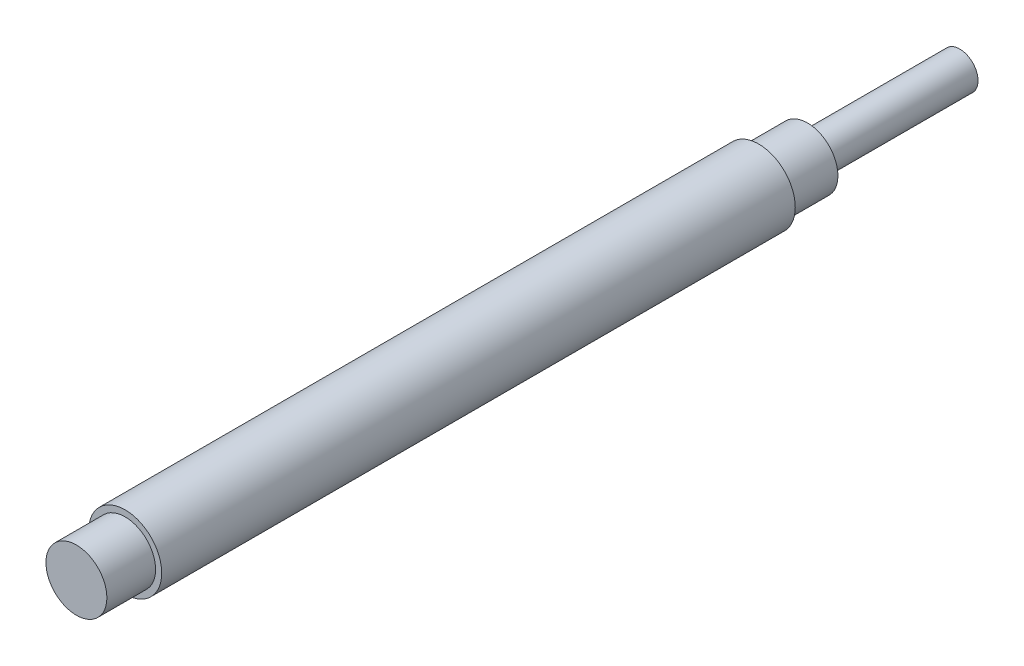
ISO-10303-21;
HEADER;
FILE_DESCRIPTION(('STEP AP214'),'2;1');
FILE_NAME('part.step','',(''),(''),'','','');
FILE_SCHEMA(('AUTOMOTIVE_DESIGN { 1 0 10303 214 1 1 1 1 }'));
ENDSEC;
DATA;
#1=APPLICATION_CONTEXT('core data for automotive mechanical design processes');
#2=APPLICATION_PROTOCOL_DEFINITION('international standard','automotive_design',2000,#1);
#3=PRODUCT_CONTEXT('',#1,'mechanical');
#4=PRODUCT('Part','Part','',(#3));
#5=PRODUCT_RELATED_PRODUCT_CATEGORY('part','',(#4));
#6=PRODUCT_DEFINITION_FORMATION('','',#4);
#7=PRODUCT_DEFINITION_CONTEXT('part definition',#1,'design');
#8=PRODUCT_DEFINITION('design','',#6,#7);
#9=PRODUCT_DEFINITION_SHAPE('','',#8);
#10=(LENGTH_UNIT() NAMED_UNIT(*) SI_UNIT(.MILLI.,.METRE.));
#11=(NAMED_UNIT(*) PLANE_ANGLE_UNIT() SI_UNIT($,.RADIAN.));
#12=(NAMED_UNIT(*) SI_UNIT($,.STERADIAN.) SOLID_ANGLE_UNIT());
#13=UNCERTAINTY_MEASURE_WITH_UNIT(LENGTH_MEASURE(1.E-05),#10,'distance_accuracy_value','');
#14=(GEOMETRIC_REPRESENTATION_CONTEXT(3) GLOBAL_UNCERTAINTY_ASSIGNED_CONTEXT((#13)) GLOBAL_UNIT_ASSIGNED_CONTEXT((#10,
#11,#12)) REPRESENTATION_CONTEXT('',''));
#15=CARTESIAN_POINT('',(0.,0.,0.));
#16=DIRECTION('',(0.,0.,1.));
#17=DIRECTION('',(1.,0.,0.));
#18=AXIS2_PLACEMENT_3D('',#15,#16,#17);
#19=CARTESIAN_POINT('',(0.,0.,72.5));
#20=DIRECTION('',(0.,0.,-1.));
#21=DIRECTION('',(-1.,0.,0.));
#22=AXIS2_PLACEMENT_3D('',#19,#20,#21);
#23=CYLINDRICAL_SURFACE('',#22,3.);
#24=CARTESIAN_POINT('',(0.,0.,16.5));
#25=DIRECTION('',(0.,0.,1.));
#26=DIRECTION('',(1.,0.,0.));
#27=AXIS2_PLACEMENT_3D('',#24,#25,#26);
#28=CIRCLE('',#27,3.);
#29=CARTESIAN_POINT('',(3.,0.,16.5));
#30=VERTEX_POINT('',#29);
#31=EDGE_CURVE('E60',#30,#30,#28,.F.);
#32=ORIENTED_EDGE('',*,*,#31,.F.);
#33=EDGE_LOOP('',(#32));
#34=FACE_BOUND('',#33,.T.);
#35=CARTESIAN_POINT('',(0.,0.,68.5));
#36=DIRECTION('',(0.,0.,1.));
#37=DIRECTION('',(1.,0.,0.));
#38=AXIS2_PLACEMENT_3D('',#35,#36,#37);
#39=CIRCLE('',#38,3.);
#40=CARTESIAN_POINT('',(3.,0.,68.5));
#41=VERTEX_POINT('',#40);
#42=EDGE_CURVE('E12',#41,#41,#39,.T.);
#43=ORIENTED_EDGE('',*,*,#42,.F.);
#44=EDGE_LOOP('',(#43));
#45=FACE_BOUND('',#44,.T.);
#46=ADVANCED_FACE('F40',(#34,#45),#23,.T.);
#47=CARTESIAN_POINT('',(0.,0.,68.5));
#48=DIRECTION('',(0.,0.,1.));
#49=DIRECTION('',(1.,0.,0.));
#50=AXIS2_PLACEMENT_3D('',#47,#48,#49);
#51=PLANE('',#50);
#52=CARTESIAN_POINT('',(0.,0.,68.5));
#53=DIRECTION('',(0.,0.,1.));
#54=DIRECTION('',(1.,0.,0.));
#55=AXIS2_PLACEMENT_3D('',#52,#53,#54);
#56=CIRCLE('',#55,2.5);
#57=CARTESIAN_POINT('',(2.5,0.,68.5));
#58=VERTEX_POINT('',#57);
#59=EDGE_CURVE('E47',#58,#58,#56,.T.);
#60=ORIENTED_EDGE('',*,*,#59,.F.);
#61=EDGE_LOOP('',(#60));
#62=FACE_BOUND('',#61,.T.);
#63=ORIENTED_EDGE('',*,*,#42,.T.);
#64=EDGE_LOOP('',(#63));
#65=FACE_BOUND('',#64,.T.);
#66=ADVANCED_FACE('F98',(#62,#65),#51,.T.);
#67=CARTESIAN_POINT('',(0.,0.,68.5));
#68=DIRECTION('',(0.,0.,1.));
#69=DIRECTION('',(1.,0.,0.));
#70=AXIS2_PLACEMENT_3D('',#67,#68,#69);
#71=CYLINDRICAL_SURFACE('',#70,2.5);
#72=ORIENTED_EDGE('',*,*,#59,.T.);
#73=EDGE_LOOP('',(#72));
#74=FACE_BOUND('',#73,.T.);
#75=CARTESIAN_POINT('',(0.,0.,72.5));
#76=DIRECTION('',(0.,0.,1.));
#77=DIRECTION('',(1.,0.,0.));
#78=AXIS2_PLACEMENT_3D('',#75,#76,#77);
#79=CIRCLE('',#78,2.5);
#80=CARTESIAN_POINT('',(2.5,0.,72.5));
#81=VERTEX_POINT('',#80);
#82=EDGE_CURVE('E52',#81,#81,#79,.T.);
#83=ORIENTED_EDGE('',*,*,#82,.F.);
#84=EDGE_LOOP('',(#83));
#85=FACE_BOUND('',#84,.T.);
#86=ADVANCED_FACE('F103',(#74,#85),#71,.T.);
#87=CARTESIAN_POINT('',(0.,0.,72.5));
#88=DIRECTION('',(0.,0.,1.));
#89=DIRECTION('',(1.,0.,0.));
#90=AXIS2_PLACEMENT_3D('',#87,#88,#89);
#91=PLANE('',#90);
#92=ORIENTED_EDGE('',*,*,#82,.T.);
#93=EDGE_LOOP('',(#92));
#94=FACE_BOUND('',#93,.T.);
#95=ADVANCED_FACE('F116',(#94),#91,.T.);
#96=CARTESIAN_POINT('',(0.,0.,76.9852813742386));
#97=DIRECTION('',(0.,0.,-1.));
#98=DIRECTION('',(-1.,0.,0.));
#99=AXIS2_PLACEMENT_3D('',#96,#97,#98);
#100=CYLINDRICAL_SURFACE('',#99,2.5);
#101=CARTESIAN_POINT('',(0.,0.,12.5));
#102=DIRECTION('',(0.,0.,1.));
#103=DIRECTION('',(1.,0.,0.));
#104=AXIS2_PLACEMENT_3D('',#101,#102,#103);
#105=CIRCLE('',#104,2.5);
#106=CARTESIAN_POINT('',(2.5,0.,12.5));
#107=VERTEX_POINT('',#106);
#108=EDGE_CURVE('E68',#107,#107,#105,.F.);
#109=ORIENTED_EDGE('',*,*,#108,.F.);
#110=EDGE_LOOP('',(#109));
#111=FACE_BOUND('',#110,.T.);
#112=CARTESIAN_POINT('',(0.,0.,16.5));
#113=DIRECTION('',(0.,0.,1.));
#114=DIRECTION('',(1.,0.,0.));
#115=AXIS2_PLACEMENT_3D('',#112,#113,#114);
#116=CIRCLE('',#115,2.5);
#117=CARTESIAN_POINT('',(2.5,0.,16.5));
#118=VERTEX_POINT('',#117);
#119=EDGE_CURVE('E58',#118,#118,#116,.F.);
#120=ORIENTED_EDGE('',*,*,#119,.T.);
#121=EDGE_LOOP('',(#120));
#122=FACE_BOUND('',#121,.T.);
#123=ADVANCED_FACE('F111',(#111,#122),#100,.T.);
#124=CARTESIAN_POINT('',(0.,0.,16.5));
#125=DIRECTION('',(0.,0.,1.));
#126=DIRECTION('',(1.,0.,0.));
#127=AXIS2_PLACEMENT_3D('',#124,#125,#126);
#128=PLANE('',#127);
#129=ORIENTED_EDGE('',*,*,#31,.T.);
#130=EDGE_LOOP('',(#129));
#131=FACE_BOUND('',#130,.T.);
#132=ORIENTED_EDGE('',*,*,#119,.F.);
#133=EDGE_LOOP('',(#132));
#134=FACE_BOUND('',#133,.T.);
#135=ADVANCED_FACE('F86',(#131,#134),#128,.F.);
#136=CARTESIAN_POINT('',(0.,0.,23.5710678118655));
#137=DIRECTION('',(0.,0.,-1.));
#138=DIRECTION('',(-1.,0.,0.));
#139=AXIS2_PLACEMENT_3D('',#136,#137,#138);
#140=CYLINDRICAL_SURFACE('',#139,1.5);
#141=CARTESIAN_POINT('',(0.,0.,0.));
#142=DIRECTION('',(0.,0.,-1.));
#143=DIRECTION('',(-1.,0.,0.));
#144=AXIS2_PLACEMENT_3D('',#141,#142,#143);
#145=CIRCLE('',#144,1.5);
#146=CARTESIAN_POINT('',(-1.5,0.,0.));
#147=VERTEX_POINT('',#146);
#148=EDGE_CURVE('E72',#147,#147,#145,.T.);
#149=ORIENTED_EDGE('',*,*,#148,.F.);
#150=EDGE_LOOP('',(#149));
#151=FACE_BOUND('',#150,.T.);
#152=CARTESIAN_POINT('',(0.,0.,12.5));
#153=DIRECTION('',(0.,0.,1.));
#154=DIRECTION('',(1.,0.,0.));
#155=AXIS2_PLACEMENT_3D('',#152,#153,#154);
#156=CIRCLE('',#155,1.5);
#157=CARTESIAN_POINT('',(1.5,0.,12.5));
#158=VERTEX_POINT('',#157);
#159=EDGE_CURVE('E64',#158,#158,#156,.F.);
#160=ORIENTED_EDGE('',*,*,#159,.T.);
#161=EDGE_LOOP('',(#160));
#162=FACE_BOUND('',#161,.T.);
#163=ADVANCED_FACE('F82',(#151,#162),#140,.T.);
#164=CARTESIAN_POINT('',(0.,0.,12.5));
#165=DIRECTION('',(0.,0.,1.));
#166=DIRECTION('',(1.,0.,0.));
#167=AXIS2_PLACEMENT_3D('',#164,#165,#166);
#168=PLANE('',#167);
#169=ORIENTED_EDGE('',*,*,#108,.T.);
#170=EDGE_LOOP('',(#169));
#171=FACE_BOUND('',#170,.T.);
#172=ORIENTED_EDGE('',*,*,#159,.F.);
#173=EDGE_LOOP('',(#172));
#174=FACE_BOUND('',#173,.T.);
#175=ADVANCED_FACE('F85',(#171,#174),#168,.F.);
#176=CARTESIAN_POINT('',(0.,0.,0.));
#177=DIRECTION('',(0.,0.,1.));
#178=DIRECTION('',(1.,0.,0.));
#179=AXIS2_PLACEMENT_3D('',#176,#177,#178);
#180=PLANE('',#179);
#181=ORIENTED_EDGE('',*,*,#148,.T.);
#182=EDGE_LOOP('',(#181));
#183=FACE_BOUND('',#182,.T.);
#184=ADVANCED_FACE('F80',(#183),#180,.F.);
#185=CLOSED_SHELL('',(#46,#66,#86,#95,#123,#135,#163,#175,#184));
#186=MANIFOLD_SOLID_BREP('B2',#185);
#187=ADVANCED_BREP_SHAPE_REPRESENTATION('',(#18,#186),#14);
#188=SHAPE_DEFINITION_REPRESENTATION(#9,#187);
ENDSEC;
END-ISO-10303-21;
